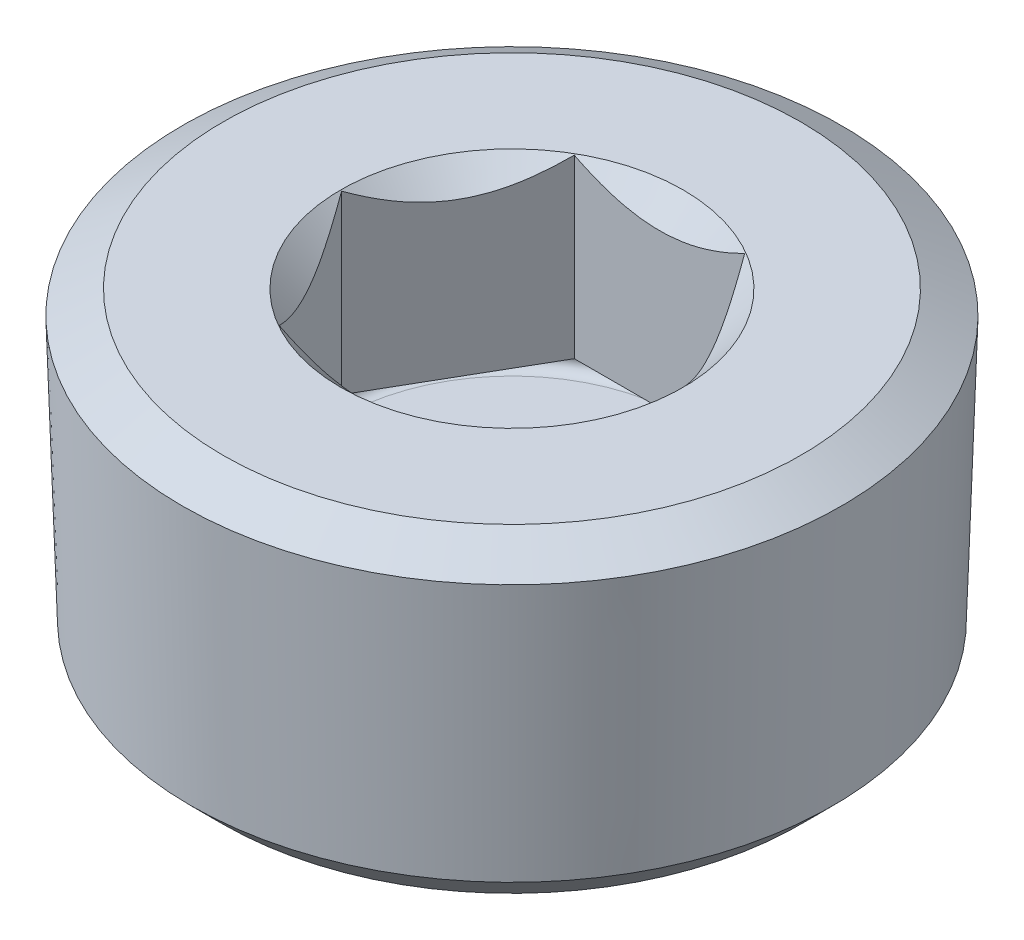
from build123d import *

# Parameters (mm, degrees)
CUT_EXTRUDE1_START = -11.43
CUT_EXTRUDE1_DEPTH = 11.379523


with BuildPart() as part:
    # Sketch2 → Revolve1 (revolve)
    with BuildSketch(Plane.XY, mode=Mode.PRIVATE) as revolve1_sk:
        Polygon((0, 0), (-18.647463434, 0), (-21.275927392, -1.517544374), (-20.744939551, -18.527323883), (-18.647463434, -20.6248), (0, -20.6248), align=None)
    revolve(revolve1_sk.sketch.rotate(Axis((0, 10.744282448, 0), (0, -1, 0)), 270), axis=Axis((0, 10.744282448, 0), (0, -1, 0)))

    # Sketch3 → Cut-Revolve1 (revolve, cut)
    with BuildSketch(Plane.XY, mode=Mode.PRIVATE) as cut_revolve1_sk:
        with BuildLine():
            Line((0, 0), (-11.049, 0))
            Line((-11.049, 0), (-9.525, -1.524))
            Line((-9.525, -1.524), (-9.525, -11.43))
            Line((-9.525, -11.43), (-11.049, -11.43))
            ThreePointArc((-11.049, -11.43), (-11.684, -12.065), (-11.049, -12.7))
            Line((-11.049, -12.7), (0, -12.7))
            Line((0, -12.7), (0, 0))
        make_face()
    revolve(cut_revolve1_sk.sketch.rotate(Axis((0, 2.934222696, 0), (0, -1, 0)), 270), axis=Axis((0, 2.934222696, 0), (0, -1, 0)), mode=Mode.SUBTRACT)

    # Sketch4 → Cut-Extrude1 (cut)
    with BuildSketch(Plane(origin=(0, 0, 0), x_dir=(1, 0, 0), z_dir=(0, 1, 0)).offset(CUT_EXTRUDE1_START)):
        Polygon((-5.499261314, -9.525), (5.499261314, -9.525), (10.998522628, 0), (5.499261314, 9.525), (-5.499261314, 9.525), (-10.998522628, 0), align=None)
    extrude(amount=CUT_EXTRUDE1_DEPTH, mode=Mode.SUBTRACT)


solid = part.part
